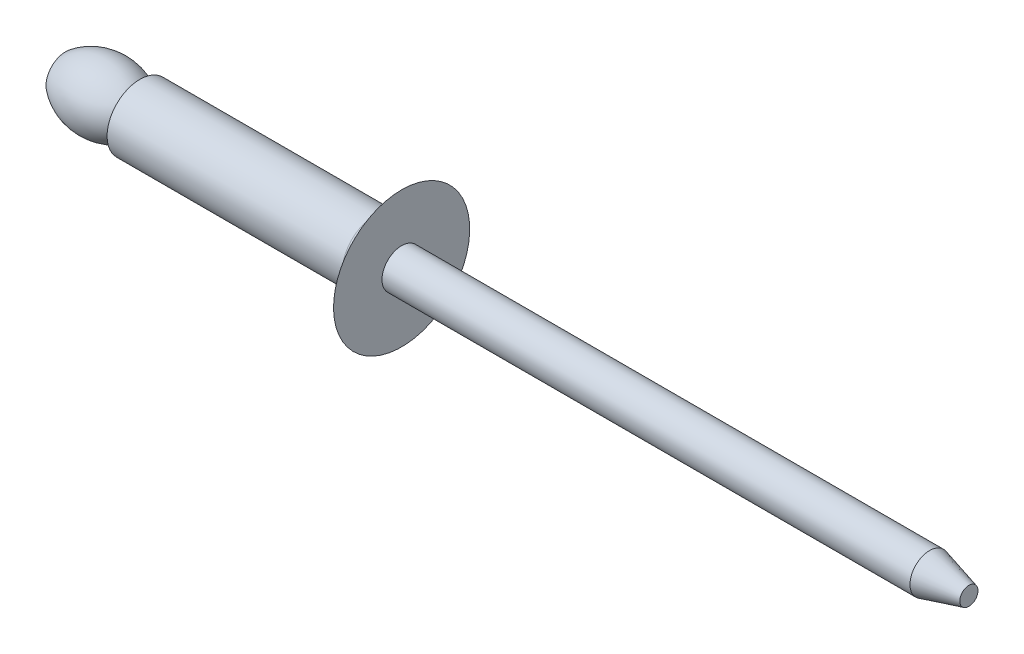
ISO-10303-21;
HEADER;
FILE_DESCRIPTION(('STEP AP214'),'2;1');
FILE_NAME('part.step','',(''),(''),'','','');
FILE_SCHEMA(('AUTOMOTIVE_DESIGN { 1 0 10303 214 1 1 1 1 }'));
ENDSEC;
DATA;
#1=APPLICATION_CONTEXT('core data for automotive mechanical design processes');
#2=APPLICATION_PROTOCOL_DEFINITION('international standard','automotive_design',2000,#1);
#3=PRODUCT_CONTEXT('',#1,'mechanical');
#4=PRODUCT('Part','Part','',(#3));
#5=PRODUCT_RELATED_PRODUCT_CATEGORY('part','',(#4));
#6=PRODUCT_DEFINITION_FORMATION('','',#4);
#7=PRODUCT_DEFINITION_CONTEXT('part definition',#1,'design');
#8=PRODUCT_DEFINITION('design','',#6,#7);
#9=PRODUCT_DEFINITION_SHAPE('','',#8);
#10=(LENGTH_UNIT() NAMED_UNIT(*) SI_UNIT(.MILLI.,.METRE.));
#11=(NAMED_UNIT(*) PLANE_ANGLE_UNIT() SI_UNIT($,.RADIAN.));
#12=(NAMED_UNIT(*) SI_UNIT($,.STERADIAN.) SOLID_ANGLE_UNIT());
#13=UNCERTAINTY_MEASURE_WITH_UNIT(LENGTH_MEASURE(1.E-05),#10,'distance_accuracy_value','');
#14=(GEOMETRIC_REPRESENTATION_CONTEXT(3) GLOBAL_UNCERTAINTY_ASSIGNED_CONTEXT((#13)) GLOBAL_UNIT_ASSIGNED_CONTEXT((#10,
#11,#12)) REPRESENTATION_CONTEXT('',''));
#15=CARTESIAN_POINT('',(0.,0.,0.));
#16=DIRECTION('',(0.,0.,1.));
#17=DIRECTION('',(1.,0.,0.));
#18=AXIS2_PLACEMENT_3D('',#15,#16,#17);
#19=CARTESIAN_POINT('',(43.6451206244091,0.,0.));
#20=DIRECTION('',(1.,0.,0.));
#21=DIRECTION('',(0.,1.,0.));
#22=AXIS2_PLACEMENT_3D('',#19,#20,#21);
#23=CYLINDRICAL_SURFACE('',#22,1.50000000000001);
#24=CARTESIAN_POINT('',(14.176017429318,0.,0.));
#25=DIRECTION('',(1.,0.,0.));
#26=DIRECTION('',(0.,1.,0.));
#27=AXIS2_PLACEMENT_3D('',#24,#25,#26);
#28=CIRCLE('',#27,1.50000000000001);
#29=CARTESIAN_POINT('',(14.176017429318,1.5,0.));
#30=VERTEX_POINT('',#29);
#31=EDGE_CURVE('E41',#30,#30,#28,.F.);
#32=ORIENTED_EDGE('',*,*,#31,.T.);
#33=EDGE_LOOP('',(#32));
#34=FACE_BOUND('',#33,.T.);
#35=CARTESIAN_POINT('',(3.39999999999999,0.,0.));
#36=DIRECTION('',(1.,0.,0.));
#37=DIRECTION('',(0.,1.,0.));
#38=AXIS2_PLACEMENT_3D('',#35,#36,#37);
#39=CIRCLE('',#38,1.50000000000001);
#40=CARTESIAN_POINT('',(3.39999999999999,1.5,0.));
#41=VERTEX_POINT('',#40);
#42=EDGE_CURVE('E50',#41,#41,#39,.T.);
#43=ORIENTED_EDGE('',*,*,#42,.T.);
#44=EDGE_LOOP('',(#43));
#45=FACE_BOUND('',#44,.T.);
#46=ADVANCED_FACE('F30',(#34,#45),#23,.T.);
#47=CARTESIAN_POINT('',(3.39999999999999,-0.900000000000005,0.));
#48=DIRECTION('',(1.,0.,0.));
#49=DIRECTION('',(0.,1.,0.));
#50=AXIS2_PLACEMENT_3D('',#47,#48,#49);
#51=PLANE('',#50);
#52=ORIENTED_EDGE('',*,*,#42,.F.);
#53=EDGE_LOOP('',(#52));
#54=FACE_BOUND('',#53,.T.);
#55=CARTESIAN_POINT('',(3.39999999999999,0.,0.));
#56=DIRECTION('',(1.,0.,0.));
#57=DIRECTION('',(0.,1.,0.));
#58=AXIS2_PLACEMENT_3D('',#55,#56,#57);
#59=CIRCLE('',#58,0.900000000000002);
#60=CARTESIAN_POINT('',(3.39999999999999,0.899999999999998,0.));
#61=VERTEX_POINT('',#60);
#62=EDGE_CURVE('E53',#61,#61,#59,.T.);
#63=ORIENTED_EDGE('',*,*,#62,.T.);
#64=EDGE_LOOP('',(#63));
#65=FACE_BOUND('',#64,.T.);
#66=ADVANCED_FACE('F82',(#54,#65),#51,.F.);
#67=CARTESIAN_POINT('',(1.69999999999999,0.,0.));
#68=DIRECTION('',(1.,0.,0.));
#69=DIRECTION('',(0.,1.,0.));
#70=AXIS2_PLACEMENT_3D('',#67,#68,#69);
#71=DEGENERATE_TOROIDAL_SURFACE('',#70,1.20833333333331,2.70833333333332,.F.);
#72=ORIENTED_EDGE('',*,*,#62,.F.);
#73=EDGE_LOOP('',(#72));
#74=FACE_BOUND('',#73,.T.);
#75=CARTESIAN_POINT('',(0.,0.,0.));
#76=DIRECTION('',(1.,0.,0.));
#77=DIRECTION('',(0.,1.,0.));
#78=AXIS2_PLACEMENT_3D('',#75,#76,#77);
#79=CIRCLE('',#78,0.900000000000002);
#80=CARTESIAN_POINT('',(0.,0.899999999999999,0.));
#81=VERTEX_POINT('',#80);
#82=EDGE_CURVE('E56',#81,#81,#79,.T.);
#83=ORIENTED_EDGE('',*,*,#82,.T.);
#84=EDGE_LOOP('',(#83));
#85=FACE_BOUND('',#84,.T.);
#86=ADVANCED_FACE('F88',(#74,#85),#71,.F.);
#87=CARTESIAN_POINT('',(0.,-0.900000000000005,0.));
#88=DIRECTION('',(1.,0.,0.));
#89=DIRECTION('',(0.,1.,0.));
#90=AXIS2_PLACEMENT_3D('',#87,#88,#89);
#91=PLANE('',#90);
#92=ORIENTED_EDGE('',*,*,#82,.F.);
#93=EDGE_LOOP('',(#92));
#94=FACE_BOUND('',#93,.T.);
#95=ADVANCED_FACE('F95',(#94),#91,.F.);
#96=CARTESIAN_POINT('',(41.4,-0.900000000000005,0.));
#97=DIRECTION('',(-1.,0.,0.));
#98=DIRECTION('',(0.,-1.,0.));
#99=AXIS2_PLACEMENT_3D('',#96,#97,#98);
#100=PLANE('',#99);
#101=CARTESIAN_POINT('',(41.4,0.,0.));
#102=DIRECTION('',(-1.,0.,0.));
#103=DIRECTION('',(0.,-1.,0.));
#104=AXIS2_PLACEMENT_3D('',#101,#102,#103);
#105=CIRCLE('',#104,0.417691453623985);
#106=CARTESIAN_POINT('',(41.4,-0.417691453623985,0.));
#107=VERTEX_POINT('',#106);
#108=EDGE_CURVE('E37',#107,#107,#105,.F.);
#109=ORIENTED_EDGE('',*,*,#108,.T.);
#110=EDGE_LOOP('',(#109));
#111=FACE_BOUND('',#110,.T.);
#112=ADVANCED_FACE('F99',(#111),#100,.F.);
#113=CARTESIAN_POINT('',(43.6451206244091,0.,0.));
#114=DIRECTION('',(1.,0.,0.));
#115=DIRECTION('',(0.,1.,0.));
#116=AXIS2_PLACEMENT_3D('',#113,#114,#115);
#117=CYLINDRICAL_SURFACE('',#116,0.900000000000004);
#118=CARTESIAN_POINT('',(39.6,0.,0.));
#119=DIRECTION('',(-1.,0.,0.));
#120=DIRECTION('',(0.,-1.,0.));
#121=AXIS2_PLACEMENT_3D('',#118,#119,#120);
#122=CIRCLE('',#121,0.900000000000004);
#123=CARTESIAN_POINT('',(39.6,-0.900000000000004,0.));
#124=VERTEX_POINT('',#123);
#125=EDGE_CURVE('E10',#124,#124,#122,.T.);
#126=ORIENTED_EDGE('',*,*,#125,.T.);
#127=EDGE_LOOP('',(#126));
#128=FACE_BOUND('',#127,.T.);
#129=CARTESIAN_POINT('',(15.4,0.,0.));
#130=DIRECTION('',(1.,0.,0.));
#131=DIRECTION('',(0.,1.,0.));
#132=AXIS2_PLACEMENT_3D('',#129,#130,#131);
#133=CIRCLE('',#132,0.900000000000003);
#134=CARTESIAN_POINT('',(15.4,0.9,0.));
#135=VERTEX_POINT('',#134);
#136=EDGE_CURVE('E59',#135,#135,#133,.T.);
#137=ORIENTED_EDGE('',*,*,#136,.T.);
#138=EDGE_LOOP('',(#137));
#139=FACE_BOUND('',#138,.T.);
#140=ADVANCED_FACE('F78',(#128,#139),#117,.T.);
#141=CARTESIAN_POINT('',(15.4,-3.12,0.));
#142=DIRECTION('',(-1.,0.,0.));
#143=DIRECTION('',(0.,-1.,0.));
#144=AXIS2_PLACEMENT_3D('',#141,#142,#143);
#145=PLANE('',#144);
#146=ORIENTED_EDGE('',*,*,#136,.F.);
#147=EDGE_LOOP('',(#146));
#148=FACE_BOUND('',#147,.T.);
#149=CARTESIAN_POINT('',(15.4,0.,0.));
#150=DIRECTION('',(1.,0.,0.));
#151=DIRECTION('',(0.,1.,0.));
#152=AXIS2_PLACEMENT_3D('',#149,#150,#151);
#153=CIRCLE('',#152,3.12);
#154=CARTESIAN_POINT('',(15.4,3.11999999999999,0.));
#155=VERTEX_POINT('',#154);
#156=EDGE_CURVE('E62',#155,#155,#153,.T.);
#157=ORIENTED_EDGE('',*,*,#156,.T.);
#158=EDGE_LOOP('',(#157));
#159=FACE_BOUND('',#158,.T.);
#160=ADVANCED_FACE('F66',(#148,#159),#145,.F.);
#161=CARTESIAN_POINT('',(14.4646925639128,0.,0.));
#162=DIRECTION('',(1.,0.,0.));
#163=DIRECTION('',(0.,1.,0.));
#164=AXIS2_PLACEMENT_3D('',#161,#162,#163);
#165=CONICAL_SURFACE('',#164,1.50000000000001,1.0471975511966);
#166=CARTESIAN_POINT('',(14.6090301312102,0.,0.));
#167=DIRECTION('',(1.,0.,0.));
#168=DIRECTION('',(0.,1.,0.));
#169=AXIS2_PLACEMENT_3D('',#166,#167,#168);
#170=CIRCLE('',#169,1.75000000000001);
#171=CARTESIAN_POINT('',(14.6090301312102,1.75,0.));
#172=VERTEX_POINT('',#171);
#173=EDGE_CURVE('E45',#172,#172,#170,.T.);
#174=ORIENTED_EDGE('',*,*,#173,.T.);
#175=EDGE_LOOP('',(#174));
#176=FACE_BOUND('',#175,.T.);
#177=ORIENTED_EDGE('',*,*,#156,.F.);
#178=EDGE_LOOP('',(#177));
#179=FACE_BOUND('',#178,.T.);
#180=ADVANCED_FACE('F68',(#176,#179),#165,.T.);
#181=CARTESIAN_POINT('',(14.176017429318,0.,0.));
#182=DIRECTION('',(1.,0.,0.));
#183=DIRECTION('',(0.,1.,0.));
#184=AXIS2_PLACEMENT_3D('',#181,#182,#183);
#185=TOROIDAL_SURFACE('',#184,2.00000000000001,0.5);
#186=ORIENTED_EDGE('',*,*,#31,.F.);
#187=EDGE_LOOP('',(#186));
#188=FACE_BOUND('',#187,.T.);
#189=ORIENTED_EDGE('',*,*,#173,.F.);
#190=EDGE_LOOP('',(#189));
#191=FACE_BOUND('',#190,.T.);
#192=ADVANCED_FACE('F70',(#188,#191),#185,.F.);
#193=CARTESIAN_POINT('',(41.4,0.,0.));
#194=DIRECTION('',(-1.,0.,0.));
#195=DIRECTION('',(0.,-1.,0.));
#196=AXIS2_PLACEMENT_3D('',#193,#194,#195);
#197=CONICAL_SURFACE('',#196,0.417691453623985,0.261799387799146);
#198=ORIENTED_EDGE('',*,*,#125,.F.);
#199=EDGE_LOOP('',(#198));
#200=FACE_BOUND('',#199,.T.);
#201=ORIENTED_EDGE('',*,*,#108,.F.);
#202=EDGE_LOOP('',(#201));
#203=FACE_BOUND('',#202,.T.);
#204=ADVANCED_FACE('F32',(#200,#203),#197,.T.);
#205=CLOSED_SHELL('',(#46,#66,#86,#95,#112,#140,#160,#180,#192,#204));
#206=MANIFOLD_SOLID_BREP('B2',#205);
#207=ADVANCED_BREP_SHAPE_REPRESENTATION('',(#18,#206),#14);
#208=SHAPE_DEFINITION_REPRESENTATION(#9,#207);
ENDSEC;
END-ISO-10303-21;
